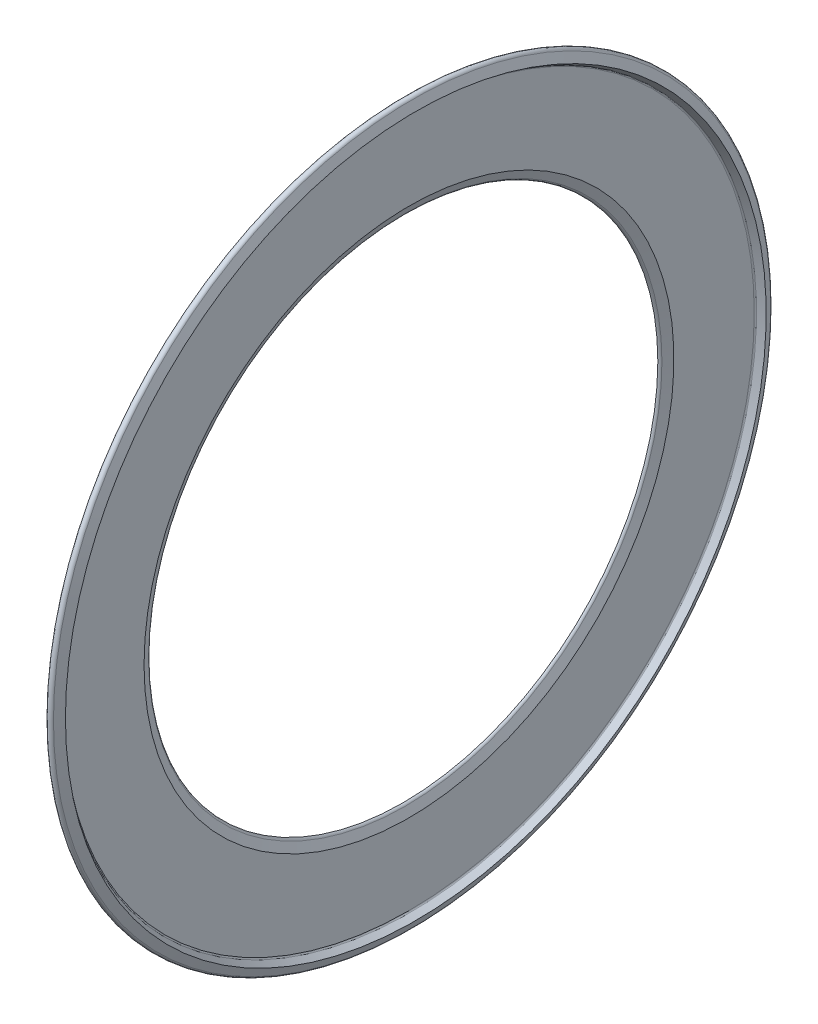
ISO-10303-21;
HEADER;
FILE_DESCRIPTION(('STEP AP214'),'2;1');
FILE_NAME('part.step','',(''),(''),'','','');
FILE_SCHEMA(('AUTOMOTIVE_DESIGN { 1 0 10303 214 1 1 1 1 }'));
ENDSEC;
DATA;
#1=APPLICATION_CONTEXT('core data for automotive mechanical design processes');
#2=APPLICATION_PROTOCOL_DEFINITION('international standard','automotive_design',2000,#1);
#3=PRODUCT_CONTEXT('',#1,'mechanical');
#4=PRODUCT('Part','Part','',(#3));
#5=PRODUCT_RELATED_PRODUCT_CATEGORY('part','',(#4));
#6=PRODUCT_DEFINITION_FORMATION('','',#4);
#7=PRODUCT_DEFINITION_CONTEXT('part definition',#1,'design');
#8=PRODUCT_DEFINITION('design','',#6,#7);
#9=PRODUCT_DEFINITION_SHAPE('','',#8);
#10=(LENGTH_UNIT() NAMED_UNIT(*) SI_UNIT(.MILLI.,.METRE.));
#11=(NAMED_UNIT(*) PLANE_ANGLE_UNIT() SI_UNIT($,.RADIAN.));
#12=(NAMED_UNIT(*) SI_UNIT($,.STERADIAN.) SOLID_ANGLE_UNIT());
#13=UNCERTAINTY_MEASURE_WITH_UNIT(LENGTH_MEASURE(1.E-05),#10,'distance_accuracy_value','');
#14=(GEOMETRIC_REPRESENTATION_CONTEXT(3) GLOBAL_UNCERTAINTY_ASSIGNED_CONTEXT((#13)) GLOBAL_UNIT_ASSIGNED_CONTEXT((#10,
#11,#12)) REPRESENTATION_CONTEXT('',''));
#15=CARTESIAN_POINT('',(0.,0.,0.));
#16=DIRECTION('',(0.,0.,1.));
#17=DIRECTION('',(1.,0.,0.));
#18=AXIS2_PLACEMENT_3D('',#15,#16,#17);
#19=CARTESIAN_POINT('',(0.599999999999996,0.,0.));
#20=DIRECTION('',(-1.,0.,0.));
#21=DIRECTION('',(0.,0.,1.));
#22=AXIS2_PLACEMENT_3D('',#19,#20,#21);
#23=TOROIDAL_SURFACE('',#22,20.9,0.2);
#24=CARTESIAN_POINT('',(0.481799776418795,0.,0.));
#25=DIRECTION('',(-1.,0.,0.));
#26=DIRECTION('',(0.,0.,1.));
#27=AXIS2_PLACEMENT_3D('',#24,#25,#26);
#28=CIRCLE('',#27,21.061334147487);
#29=CARTESIAN_POINT('',(0.481799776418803,0.,21.061334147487));
#30=VERTEX_POINT('',#29);
#31=EDGE_CURVE('E10',#30,#30,#28,.T.);
#32=ORIENTED_EDGE('',*,*,#31,.F.);
#33=EDGE_LOOP('',(#32));
#34=FACE_BOUND('',#33,.T.);
#35=CARTESIAN_POINT('',(0.782287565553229,0.,0.));
#36=DIRECTION('',(-1.,0.,0.));
#37=DIRECTION('',(0.,0.,1.));
#38=AXIS2_PLACEMENT_3D('',#35,#36,#37);
#39=CIRCLE('',#38,20.9822875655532);
#40=CARTESIAN_POINT('',(0.782287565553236,0.,20.9822875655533));
#41=VERTEX_POINT('',#40);
#42=EDGE_CURVE('E66',#41,#41,#39,.T.);
#43=ORIENTED_EDGE('',*,*,#42,.T.);
#44=EDGE_LOOP('',(#43));
#45=FACE_BOUND('',#44,.T.);
#46=ADVANCED_FACE('F29',(#34,#45),#23,.T.);
#47=CARTESIAN_POINT('',(0.481799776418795,21.061334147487,0.));
#48=DIRECTION('',(1.,0.,0.));
#49=DIRECTION('',(0.,0.,-1.));
#50=AXIS2_PLACEMENT_3D('',#47,#48,#49);
#51=PLANE('',#50);
#52=CARTESIAN_POINT('',(0.481799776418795,0.,0.));
#53=DIRECTION('',(-1.,0.,0.));
#54=DIRECTION('',(0.,0.,1.));
#55=AXIS2_PLACEMENT_3D('',#52,#53,#54);
#56=CIRCLE('',#55,20.7253996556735);
#57=CARTESIAN_POINT('',(0.481799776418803,0.,20.7253996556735));
#58=VERTEX_POINT('',#57);
#59=EDGE_CURVE('E35',#58,#58,#56,.T.);
#60=ORIENTED_EDGE('',*,*,#59,.F.);
#61=EDGE_LOOP('',(#60));
#62=FACE_BOUND('',#61,.T.);
#63=ORIENTED_EDGE('',*,*,#31,.T.);
#64=EDGE_LOOP('',(#63));
#65=FACE_BOUND('',#64,.T.);
#66=ADVANCED_FACE('F121',(#62,#65),#51,.F.);
#67=CARTESIAN_POINT('',(0.481799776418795,0.,0.));
#68=DIRECTION('',(1.,0.,0.));
#69=DIRECTION('',(0.,0.,-1.));
#70=AXIS2_PLACEMENT_3D('',#67,#68,#69);
#71=CONICAL_SURFACE('',#70,20.7253996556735,0.785398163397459);
#72=CARTESIAN_POINT('',(0.398984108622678,0.,0.));
#73=DIRECTION('',(-1.,0.,0.));
#74=DIRECTION('',(0.,0.,1.));
#75=AXIS2_PLACEMENT_3D('',#72,#73,#74);
#76=CIRCLE('',#75,20.6425839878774);
#77=CARTESIAN_POINT('',(0.398984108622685,0.,20.6425839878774));
#78=VERTEX_POINT('',#77);
#79=EDGE_CURVE('E39',#78,#78,#76,.T.);
#80=ORIENTED_EDGE('',*,*,#79,.F.);
#81=EDGE_LOOP('',(#80));
#82=FACE_BOUND('',#81,.T.);
#83=ORIENTED_EDGE('',*,*,#59,.T.);
#84=EDGE_LOOP('',(#83));
#85=FACE_BOUND('',#84,.T.);
#86=ADVANCED_FACE('F116',(#82,#85),#71,.T.);
#87=CARTESIAN_POINT('',(0.752537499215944,0.,0.));
#88=DIRECTION('',(-1.,0.,0.));
#89=DIRECTION('',(0.,0.,1.));
#90=AXIS2_PLACEMENT_3D('',#87,#88,#89);
#91=TOROIDAL_SURFACE('',#90,20.2890305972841,0.499999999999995);
#92=CARTESIAN_POINT('',(0.25253749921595,0.,0.));
#93=DIRECTION('',(-1.,0.,0.));
#94=DIRECTION('',(0.,0.,1.));
#95=AXIS2_PLACEMENT_3D('',#92,#93,#94);
#96=CIRCLE('',#95,20.2890305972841);
#97=CARTESIAN_POINT('',(0.252537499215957,0.,20.2890305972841));
#98=VERTEX_POINT('',#97);
#99=EDGE_CURVE('E43',#98,#98,#96,.T.);
#100=ORIENTED_EDGE('',*,*,#99,.F.);
#101=EDGE_LOOP('',(#100));
#102=FACE_BOUND('',#101,.T.);
#103=ORIENTED_EDGE('',*,*,#79,.T.);
#104=EDGE_LOOP('',(#103));
#105=FACE_BOUND('',#104,.T.);
#106=ADVANCED_FACE('F110',(#102,#105),#91,.T.);
#107=CARTESIAN_POINT('',(0.25253749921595,20.2890305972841,0.));
#108=DIRECTION('',(1.,0.,0.));
#109=DIRECTION('',(0.,0.,-1.));
#110=AXIS2_PLACEMENT_3D('',#107,#108,#109);
#111=PLANE('',#110);
#112=CARTESIAN_POINT('',(0.25253749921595,0.,0.));
#113=DIRECTION('',(-1.,0.,0.));
#114=DIRECTION('',(0.,0.,1.));
#115=AXIS2_PLACEMENT_3D('',#112,#113,#114);
#116=CIRCLE('',#115,14.9070238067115);
#117=CARTESIAN_POINT('',(0.252537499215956,0.,14.9070238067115));
#118=VERTEX_POINT('',#117);
#119=EDGE_CURVE('E48',#118,#118,#116,.T.);
#120=ORIENTED_EDGE('',*,*,#119,.F.);
#121=EDGE_LOOP('',(#120));
#122=FACE_BOUND('',#121,.T.);
#123=ORIENTED_EDGE('',*,*,#99,.T.);
#124=EDGE_LOOP('',(#123));
#125=FACE_BOUND('',#124,.T.);
#126=ADVANCED_FACE('F104',(#122,#125),#111,.F.);
#127=CARTESIAN_POINT('',(0.199999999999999,0.,0.));
#128=DIRECTION('',(-1.,0.,0.));
#129=DIRECTION('',(0.,0.,1.));
#130=AXIS2_PLACEMENT_3D('',#127,#128,#129);
#131=TOROIDAL_SURFACE('',#130,15.1,0.2);
#132=CARTESIAN_POINT('',(0.382287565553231,0.,0.));
#133=DIRECTION('',(-1.,0.,0.));
#134=DIRECTION('',(0.,0.,1.));
#135=AXIS2_PLACEMENT_3D('',#132,#133,#134);
#136=CIRCLE('',#135,15.0177124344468);
#137=CARTESIAN_POINT('',(0.382287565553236,0.,15.0177124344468));
#138=VERTEX_POINT('',#137);
#139=EDGE_CURVE('E51',#138,#138,#136,.T.);
#140=ORIENTED_EDGE('',*,*,#139,.F.);
#141=EDGE_LOOP('',(#140));
#142=FACE_BOUND('',#141,.T.);
#143=ORIENTED_EDGE('',*,*,#119,.T.);
#144=EDGE_LOOP('',(#143));
#145=FACE_BOUND('',#144,.T.);
#146=ADVANCED_FACE('F98',(#142,#145),#131,.T.);
#147=CARTESIAN_POINT('',(0.382287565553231,0.,0.));
#148=DIRECTION('',(1.,0.,0.));
#149=DIRECTION('',(0.,0.,-1.));
#150=AXIS2_PLACEMENT_3D('',#147,#148,#149);
#151=CONICAL_SURFACE('',#150,15.0177124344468,1.14676528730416);
#152=CARTESIAN_POINT('',(0.599999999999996,0.,0.));
#153=DIRECTION('',(-1.,0.,0.));
#154=DIRECTION('',(0.,0.,1.));
#155=AXIS2_PLACEMENT_3D('',#152,#153,#154);
#156=CIRCLE('',#155,15.5);
#157=CARTESIAN_POINT('',(0.600000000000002,0.,15.5));
#158=VERTEX_POINT('',#157);
#159=EDGE_CURVE('E54',#158,#158,#156,.T.);
#160=ORIENTED_EDGE('',*,*,#159,.F.);
#161=EDGE_LOOP('',(#160));
#162=FACE_BOUND('',#161,.T.);
#163=ORIENTED_EDGE('',*,*,#139,.T.);
#164=EDGE_LOOP('',(#163));
#165=FACE_BOUND('',#164,.T.);
#166=ADVANCED_FACE('F92',(#162,#165),#151,.F.);
#167=CARTESIAN_POINT('',(0.599999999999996,15.5,0.));
#168=DIRECTION('',(-1.,0.,0.));
#169=DIRECTION('',(0.,0.,1.));
#170=AXIS2_PLACEMENT_3D('',#167,#168,#169);
#171=PLANE('',#170);
#172=CARTESIAN_POINT('',(0.599999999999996,0.,0.));
#173=DIRECTION('',(-1.,0.,0.));
#174=DIRECTION('',(0.,0.,1.));
#175=AXIS2_PLACEMENT_3D('',#172,#173,#174);
#176=CIRCLE('',#175,20.198544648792);
#177=CARTESIAN_POINT('',(0.600000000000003,0.,20.1985446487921));
#178=VERTEX_POINT('',#177);
#179=EDGE_CURVE('E57',#178,#178,#176,.T.);
#180=ORIENTED_EDGE('',*,*,#179,.F.);
#181=EDGE_LOOP('',(#180));
#182=FACE_BOUND('',#181,.T.);
#183=ORIENTED_EDGE('',*,*,#159,.T.);
#184=EDGE_LOOP('',(#183));
#185=FACE_BOUND('',#184,.T.);
#186=ADVANCED_FACE('F86',(#182,#185),#171,.F.);
#187=CARTESIAN_POINT('',(0.699999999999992,0.,0.));
#188=DIRECTION('',(-1.,0.,0.));
#189=DIRECTION('',(0.,0.,1.));
#190=AXIS2_PLACEMENT_3D('',#187,#188,#189);
#191=TOROIDAL_SURFACE('',#190,20.198544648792,0.0999999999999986);
#192=CARTESIAN_POINT('',(0.647691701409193,0.,0.));
#193=DIRECTION('',(-1.,0.,0.));
#194=DIRECTION('',(0.,0.,1.));
#195=AXIS2_PLACEMENT_3D('',#192,#193,#194);
#196=CIRCLE('',#195,20.283772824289);
#197=CARTESIAN_POINT('',(0.6476917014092,0.,20.283772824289));
#198=VERTEX_POINT('',#197);
#199=EDGE_CURVE('E60',#198,#198,#196,.T.);
#200=ORIENTED_EDGE('',*,*,#199,.F.);
#201=EDGE_LOOP('',(#200));
#202=FACE_BOUND('',#201,.T.);
#203=ORIENTED_EDGE('',*,*,#179,.T.);
#204=EDGE_LOOP('',(#203));
#205=FACE_BOUND('',#204,.T.);
#206=ADVANCED_FACE('F80',(#202,#205),#191,.F.);
#207=CARTESIAN_POINT('',(0.647691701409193,0.,0.));
#208=DIRECTION('',(1.,0.,0.));
#209=DIRECTION('',(0.,0.,-1.));
#210=AXIS2_PLACEMENT_3D('',#207,#208,#209);
#211=CONICAL_SURFACE('',#210,20.283772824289,0.550464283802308);
#212=CARTESIAN_POINT('',(0.999999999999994,0.,0.));
#213=DIRECTION('',(-1.,0.,0.));
#214=DIRECTION('',(0.,0.,1.));
#215=AXIS2_PLACEMENT_3D('',#212,#213,#214);
#216=CIRCLE('',#215,20.5);
#217=CARTESIAN_POINT('',(1.,0.,20.5));
#218=VERTEX_POINT('',#217);
#219=EDGE_CURVE('E63',#218,#218,#216,.T.);
#220=ORIENTED_EDGE('',*,*,#219,.F.);
#221=EDGE_LOOP('',(#220));
#222=FACE_BOUND('',#221,.T.);
#223=ORIENTED_EDGE('',*,*,#199,.T.);
#224=EDGE_LOOP('',(#223));
#225=FACE_BOUND('',#224,.T.);
#226=ADVANCED_FACE('F74',(#222,#225),#211,.F.);
#227=CARTESIAN_POINT('',(0.999999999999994,0.,0.));
#228=DIRECTION('',(-1.,0.,0.));
#229=DIRECTION('',(0.,0.,1.));
#230=AXIS2_PLACEMENT_3D('',#227,#228,#229);
#231=CONICAL_SURFACE('',#230,20.5,1.14676528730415);
#232=ORIENTED_EDGE('',*,*,#42,.F.);
#233=EDGE_LOOP('',(#232));
#234=FACE_BOUND('',#233,.T.);
#235=ORIENTED_EDGE('',*,*,#219,.T.);
#236=EDGE_LOOP('',(#235));
#237=FACE_BOUND('',#236,.T.);
#238=ADVANCED_FACE('F71',(#234,#237),#231,.T.);
#239=CLOSED_SHELL('',(#46,#66,#86,#106,#126,#146,#166,#186,#206,#226,#238));
#240=MANIFOLD_SOLID_BREP('B2',#239);
#241=ADVANCED_BREP_SHAPE_REPRESENTATION('',(#18,#240),#14);
#242=SHAPE_DEFINITION_REPRESENTATION(#9,#241);
ENDSEC;
END-ISO-10303-21;
